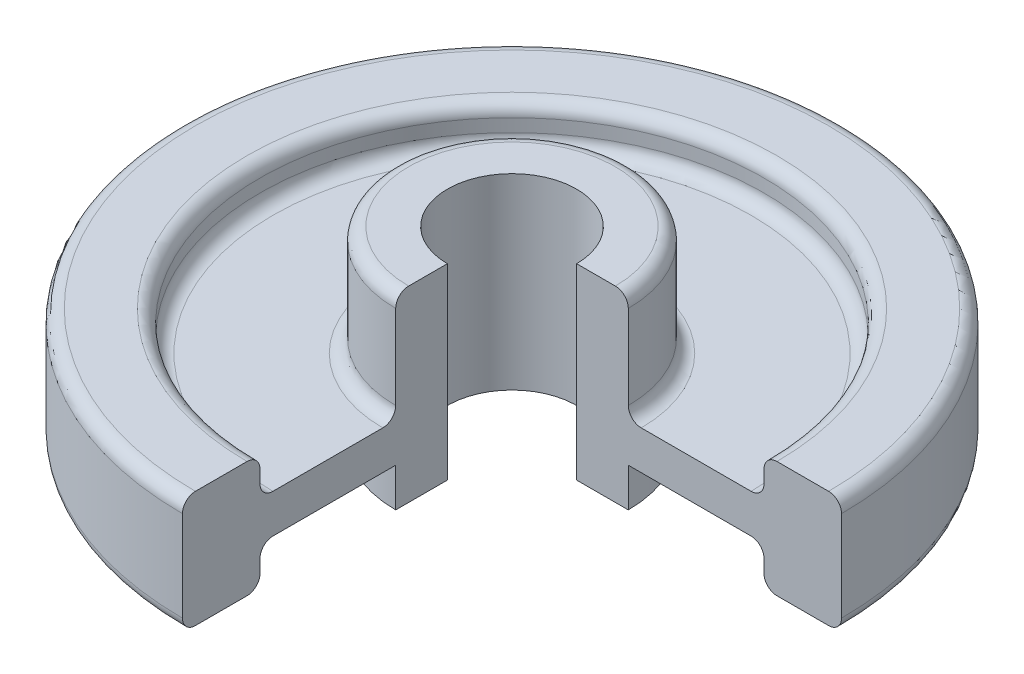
ISO-10303-21;
HEADER;
FILE_DESCRIPTION(('STEP AP214'),'2;1');
FILE_NAME('part.step','',(''),(''),'','','');
FILE_SCHEMA(('AUTOMOTIVE_DESIGN { 1 0 10303 214 1 1 1 1 }'));
ENDSEC;
DATA;
#1=APPLICATION_CONTEXT('core data for automotive mechanical design processes');
#2=APPLICATION_PROTOCOL_DEFINITION('international standard','automotive_design',2000,#1);
#3=PRODUCT_CONTEXT('',#1,'mechanical');
#4=PRODUCT('Part','Part','',(#3));
#5=PRODUCT_RELATED_PRODUCT_CATEGORY('part','',(#4));
#6=PRODUCT_DEFINITION_FORMATION('','',#4);
#7=PRODUCT_DEFINITION_CONTEXT('part definition',#1,'design');
#8=PRODUCT_DEFINITION('design','',#6,#7);
#9=PRODUCT_DEFINITION_SHAPE('','',#8);
#10=(LENGTH_UNIT() NAMED_UNIT(*) SI_UNIT(.MILLI.,.METRE.));
#11=(NAMED_UNIT(*) PLANE_ANGLE_UNIT() SI_UNIT($,.RADIAN.));
#12=(NAMED_UNIT(*) SI_UNIT($,.STERADIAN.) SOLID_ANGLE_UNIT());
#13=UNCERTAINTY_MEASURE_WITH_UNIT(LENGTH_MEASURE(1.E-05),#10,'distance_accuracy_value','');
#14=(GEOMETRIC_REPRESENTATION_CONTEXT(3) GLOBAL_UNCERTAINTY_ASSIGNED_CONTEXT((#13)) GLOBAL_UNIT_ASSIGNED_CONTEXT((#10,
#11,#12)) REPRESENTATION_CONTEXT('',''));
#15=CARTESIAN_POINT('',(0.,0.,0.));
#16=DIRECTION('',(0.,0.,1.));
#17=DIRECTION('',(1.,0.,0.));
#18=AXIS2_PLACEMENT_3D('',#15,#16,#17);
#19=CARTESIAN_POINT('',(0.,0.,0.));
#20=DIRECTION('',(0.,-1.,0.));
#21=DIRECTION('',(0.,0.,-1.));
#22=AXIS2_PLACEMENT_3D('',#19,#20,#21);
#23=PLANE('',#22);
#24=DIRECTION('',(-1.,0.,0.));
#25=VECTOR('',#24,1.);
#26=CARTESIAN_POINT('',(80.9625,0.,0.));
#27=LINE('',#26,#25);
#28=CARTESIAN_POINT('',(28.575,0.,0.));
#29=VERTEX_POINT('',#28);
#30=CARTESIAN_POINT('',(15.875,0.,0.));
#31=VERTEX_POINT('',#30);
#32=EDGE_CURVE('E171',#29,#31,#27,.T.);
#33=ORIENTED_EDGE('',*,*,#32,.T.);
#34=CARTESIAN_POINT('',(0.,0.,0.));
#35=DIRECTION('',(0.,1.,0.));
#36=DIRECTION('',(0.,0.,1.));
#37=AXIS2_PLACEMENT_3D('',#34,#35,#36);
#38=CIRCLE('',#37,15.875);
#39=CARTESIAN_POINT('',(0.,0.,15.875));
#40=VERTEX_POINT('',#39);
#41=EDGE_CURVE('E228',#31,#40,#38,.T.);
#42=ORIENTED_EDGE('',*,*,#41,.T.);
#43=DIRECTION('',(0.,0.,1.));
#44=VECTOR('',#43,1.);
#45=CARTESIAN_POINT('',(0.,0.,0.));
#46=LINE('',#45,#44);
#47=CARTESIAN_POINT('',(0.,0.,28.575));
#48=VERTEX_POINT('',#47);
#49=EDGE_CURVE('E316',#40,#48,#46,.T.);
#50=ORIENTED_EDGE('',*,*,#49,.T.);
#51=CARTESIAN_POINT('',(0.,0.,0.));
#52=DIRECTION('',(0.,-1.,0.));
#53=DIRECTION('',(0.,0.,-1.));
#54=AXIS2_PLACEMENT_3D('',#51,#52,#53);
#55=CIRCLE('',#54,28.575);
#56=EDGE_CURVE('E237',#48,#29,#55,.T.);
#57=ORIENTED_EDGE('',*,*,#56,.T.);
#58=EDGE_LOOP('',(#33,#42,#50,#57));
#59=FACE_BOUND('',#58,.T.);
#60=ADVANCED_FACE('F28',(#59),#23,.T.);
#61=CARTESIAN_POINT('',(77.7875,0.,0.));
#62=VERTEX_POINT('',#61);
#63=CARTESIAN_POINT('',(65.0875,0.,0.));
#64=VERTEX_POINT('',#63);
#65=EDGE_CURVE('E162',#62,#64,#27,.T.);
#66=ORIENTED_EDGE('',*,*,#65,.T.);
#67=CARTESIAN_POINT('',(0.,0.,0.));
#68=DIRECTION('',(0.,-1.,0.));
#69=DIRECTION('',(0.,0.,-1.));
#70=AXIS2_PLACEMENT_3D('',#67,#68,#69);
#71=CIRCLE('',#70,65.0875);
#72=CARTESIAN_POINT('',(0.,0.,65.0875));
#73=VERTEX_POINT('',#72);
#74=EDGE_CURVE('E184',#64,#73,#71,.F.);
#75=ORIENTED_EDGE('',*,*,#74,.T.);
#76=CARTESIAN_POINT('',(0.,0.,77.7875));
#77=VERTEX_POINT('',#76);
#78=EDGE_CURVE('E50',#73,#77,#46,.T.);
#79=ORIENTED_EDGE('',*,*,#78,.T.);
#80=CARTESIAN_POINT('',(0.,0.,0.));
#81=DIRECTION('',(0.,-1.,0.));
#82=DIRECTION('',(0.,0.,-1.));
#83=AXIS2_PLACEMENT_3D('',#80,#81,#82);
#84=CIRCLE('',#83,77.7875);
#85=EDGE_CURVE('E178',#77,#62,#84,.T.);
#86=ORIENTED_EDGE('',*,*,#85,.T.);
#87=EDGE_LOOP('',(#66,#75,#79,#86));
#88=FACE_BOUND('',#87,.T.);
#89=ADVANCED_FACE('F30',(#88),#23,.T.);
#90=CARTESIAN_POINT('',(0.,0.,0.));
#91=DIRECTION('',(0.,-1.,0.));
#92=DIRECTION('',(0.,0.,-1.));
#93=AXIS2_PLACEMENT_3D('',#90,#91,#92);
#94=CYLINDRICAL_SURFACE('',#93,80.9625);
#95=DIRECTION('',(0.,1.,0.));
#96=VECTOR('',#95,1.);
#97=CARTESIAN_POINT('',(80.9625,0.,0.));
#98=LINE('',#97,#96);
#99=CARTESIAN_POINT('',(80.9625,3.175,0.));
#100=VERTEX_POINT('',#99);
#101=CARTESIAN_POINT('',(80.9625,25.4,0.));
#102=VERTEX_POINT('',#101);
#103=EDGE_CURVE('E312',#100,#102,#98,.T.);
#104=ORIENTED_EDGE('',*,*,#103,.F.);
#105=CARTESIAN_POINT('',(0.,3.175,0.));
#106=DIRECTION('',(0.,-1.,0.));
#107=DIRECTION('',(0.,0.,-1.));
#108=AXIS2_PLACEMENT_3D('',#105,#106,#107);
#109=CIRCLE('',#108,80.9625);
#110=CARTESIAN_POINT('',(0.,3.175,80.9625));
#111=VERTEX_POINT('',#110);
#112=EDGE_CURVE('E180',#100,#111,#109,.F.);
#113=ORIENTED_EDGE('',*,*,#112,.T.);
#114=DIRECTION('',(0.,1.,0.));
#115=VECTOR('',#114,1.);
#116=CARTESIAN_POINT('',(0.,0.,80.9625));
#117=LINE('',#116,#115);
#118=CARTESIAN_POINT('',(0.,25.4,80.9625));
#119=VERTEX_POINT('',#118);
#120=EDGE_CURVE('E313',#111,#119,#117,.T.);
#121=ORIENTED_EDGE('',*,*,#120,.T.);
#122=CARTESIAN_POINT('',(0.,25.4,0.));
#123=DIRECTION('',(0.,1.,0.));
#124=DIRECTION('',(0.,0.,1.));
#125=AXIS2_PLACEMENT_3D('',#122,#123,#124);
#126=CIRCLE('',#125,80.9625);
#127=EDGE_CURVE('E186',#119,#102,#126,.F.);
#128=ORIENTED_EDGE('',*,*,#127,.T.);
#129=EDGE_LOOP('',(#104,#113,#121,#128));
#130=FACE_BOUND('',#129,.T.);
#131=ADVANCED_FACE('F371',(#130),#94,.T.);
#132=CARTESIAN_POINT('',(80.9625,28.575,0.));
#133=DIRECTION('',(0.,1.,0.));
#134=DIRECTION('',(0.,0.,1.));
#135=AXIS2_PLACEMENT_3D('',#132,#133,#134);
#136=PLANE('',#135);
#137=DIRECTION('',(-1.,0.,0.));
#138=VECTOR('',#137,1.);
#139=CARTESIAN_POINT('',(80.9625,28.575,0.));
#140=LINE('',#139,#138);
#141=CARTESIAN_POINT('',(77.7875,28.575,0.));
#142=VERTEX_POINT('',#141);
#143=CARTESIAN_POINT('',(65.0875,28.575,0.));
#144=VERTEX_POINT('',#143);
#145=EDGE_CURVE('E261',#142,#144,#140,.T.);
#146=ORIENTED_EDGE('',*,*,#145,.F.);
#147=CARTESIAN_POINT('',(0.,28.575,0.));
#148=DIRECTION('',(0.,1.,0.));
#149=DIRECTION('',(0.,0.,1.));
#150=AXIS2_PLACEMENT_3D('',#147,#148,#149);
#151=CIRCLE('',#150,77.7875);
#152=CARTESIAN_POINT('',(0.,28.575,77.7875));
#153=VERTEX_POINT('',#152);
#154=EDGE_CURVE('E195',#142,#153,#151,.T.);
#155=ORIENTED_EDGE('',*,*,#154,.T.);
#156=DIRECTION('',(0.,0.,1.));
#157=VECTOR('',#156,1.);
#158=CARTESIAN_POINT('',(0.,28.575,0.));
#159=LINE('',#158,#157);
#160=CARTESIAN_POINT('',(0.,28.575,65.0875));
#161=VERTEX_POINT('',#160);
#162=EDGE_CURVE('E294',#161,#153,#159,.T.);
#163=ORIENTED_EDGE('',*,*,#162,.F.);
#164=CARTESIAN_POINT('',(0.,28.575,0.));
#165=DIRECTION('',(0.,1.,0.));
#166=DIRECTION('',(0.,0.,1.));
#167=AXIS2_PLACEMENT_3D('',#164,#165,#166);
#168=CIRCLE('',#167,65.0875);
#169=EDGE_CURVE('E192',#161,#144,#168,.F.);
#170=ORIENTED_EDGE('',*,*,#169,.T.);
#171=EDGE_LOOP('',(#146,#155,#163,#170));
#172=FACE_BOUND('',#171,.T.);
#173=ADVANCED_FACE('F363',(#172),#136,.T.);
#174=CARTESIAN_POINT('',(0.,0.,0.));
#175=DIRECTION('',(0.,-1.,0.));
#176=DIRECTION('',(0.,0.,-1.));
#177=AXIS2_PLACEMENT_3D('',#174,#175,#176);
#178=CYLINDRICAL_SURFACE('',#177,28.575);
#179=DIRECTION('',(0.,-1.,0.));
#180=VECTOR('',#179,1.);
#181=CARTESIAN_POINT('',(28.575,0.,0.));
#182=LINE('',#181,#180);
#183=CARTESIAN_POINT('',(28.575,22.225,0.));
#184=VERTEX_POINT('',#183);
#185=CARTESIAN_POINT('',(28.575,42.8752,0.));
#186=VERTEX_POINT('',#185);
#187=EDGE_CURVE('E245',#184,#186,#182,.F.);
#188=ORIENTED_EDGE('',*,*,#187,.F.);
#189=CARTESIAN_POINT('',(0.,22.225,0.));
#190=DIRECTION('',(0.,-1.,0.));
#191=DIRECTION('',(0.,0.,-1.));
#192=AXIS2_PLACEMENT_3D('',#189,#190,#191);
#193=CIRCLE('',#192,28.575);
#194=CARTESIAN_POINT('',(0.,22.225,28.575));
#195=VERTEX_POINT('',#194);
#196=EDGE_CURVE('E216',#184,#195,#193,.F.);
#197=ORIENTED_EDGE('',*,*,#196,.T.);
#198=DIRECTION('',(0.,-1.,0.));
#199=VECTOR('',#198,1.);
#200=CARTESIAN_POINT('',(0.,0.,28.575));
#201=LINE('',#200,#199);
#202=CARTESIAN_POINT('',(0.,42.8752,28.575));
#203=VERTEX_POINT('',#202);
#204=EDGE_CURVE('E278',#203,#195,#201,.T.);
#205=ORIENTED_EDGE('',*,*,#204,.F.);
#206=CARTESIAN_POINT('',(0.,42.8752,0.));
#207=DIRECTION('',(0.,1.,0.));
#208=DIRECTION('',(0.,0.,1.));
#209=AXIS2_PLACEMENT_3D('',#206,#207,#208);
#210=CIRCLE('',#209,28.575);
#211=EDGE_CURVE('E213',#203,#186,#210,.F.);
#212=ORIENTED_EDGE('',*,*,#211,.T.);
#213=EDGE_LOOP('',(#188,#197,#205,#212));
#214=FACE_BOUND('',#213,.T.);
#215=ADVANCED_FACE('F341',(#214),#178,.T.);
#216=CARTESIAN_POINT('',(28.575,46.0502,0.));
#217=DIRECTION('',(0.,1.,0.));
#218=DIRECTION('',(0.,0.,1.));
#219=AXIS2_PLACEMENT_3D('',#216,#217,#218);
#220=PLANE('',#219);
#221=DIRECTION('',(-1.,0.,0.));
#222=VECTOR('',#221,1.);
#223=CARTESIAN_POINT('',(80.9625,46.0502,0.));
#224=LINE('',#223,#222);
#225=CARTESIAN_POINT('',(25.4,46.0502,0.));
#226=VERTEX_POINT('',#225);
#227=CARTESIAN_POINT('',(15.875,46.0502,0.));
#228=VERTEX_POINT('',#227);
#229=EDGE_CURVE('E322',#226,#228,#224,.T.);
#230=ORIENTED_EDGE('',*,*,#229,.F.);
#231=CARTESIAN_POINT('',(0.,46.0502,0.));
#232=DIRECTION('',(0.,1.,0.));
#233=DIRECTION('',(0.,0.,1.));
#234=AXIS2_PLACEMENT_3D('',#231,#232,#233);
#235=CIRCLE('',#234,25.4);
#236=CARTESIAN_POINT('',(0.,46.0502,25.4));
#237=VERTEX_POINT('',#236);
#238=EDGE_CURVE('E210',#226,#237,#235,.T.);
#239=ORIENTED_EDGE('',*,*,#238,.T.);
#240=DIRECTION('',(0.,0.,1.));
#241=VECTOR('',#240,1.);
#242=CARTESIAN_POINT('',(0.,46.0502,0.));
#243=LINE('',#242,#241);
#244=CARTESIAN_POINT('',(0.,46.0502,15.875));
#245=VERTEX_POINT('',#244);
#246=EDGE_CURVE('E320',#245,#237,#243,.T.);
#247=ORIENTED_EDGE('',*,*,#246,.F.);
#248=CARTESIAN_POINT('',(0.,46.0502,0.));
#249=DIRECTION('',(0.,1.,0.));
#250=DIRECTION('',(0.,0.,1.));
#251=AXIS2_PLACEMENT_3D('',#248,#249,#250);
#252=CIRCLE('',#251,15.875);
#253=EDGE_CURVE('E231',#228,#245,#252,.T.);
#254=ORIENTED_EDGE('',*,*,#253,.F.);
#255=EDGE_LOOP('',(#230,#239,#247,#254));
#256=FACE_BOUND('',#255,.T.);
#257=ADVANCED_FACE('F332',(#256),#220,.T.);
#258=CARTESIAN_POINT('',(0.,0.,0.));
#259=DIRECTION('',(0.,1.,0.));
#260=DIRECTION('',(0.,0.,1.));
#261=AXIS2_PLACEMENT_3D('',#258,#259,#260);
#262=CYLINDRICAL_SURFACE('',#261,15.875);
#263=ORIENTED_EDGE('',*,*,#41,.F.);
#264=DIRECTION('',(0.,1.,0.));
#265=VECTOR('',#264,1.);
#266=CARTESIAN_POINT('',(15.875,0.,0.));
#267=LINE('',#266,#265);
#268=EDGE_CURVE('E240',#31,#228,#267,.T.);
#269=ORIENTED_EDGE('',*,*,#268,.T.);
#270=ORIENTED_EDGE('',*,*,#253,.T.);
#271=DIRECTION('',(0.,1.,0.));
#272=VECTOR('',#271,1.);
#273=CARTESIAN_POINT('',(0.,0.,15.875));
#274=LINE('',#273,#272);
#275=EDGE_CURVE('E273',#245,#40,#274,.F.);
#276=ORIENTED_EDGE('',*,*,#275,.T.);
#277=EDGE_LOOP('',(#263,#269,#270,#276));
#278=FACE_BOUND('',#277,.T.);
#279=ADVANCED_FACE('F330',(#278),#262,.F.);
#280=CARTESIAN_POINT('',(0.,0.,0.));
#281=DIRECTION('',(0.,-1.,0.));
#282=DIRECTION('',(0.,0.,-1.));
#283=AXIS2_PLACEMENT_3D('',#280,#281,#282);
#284=CYLINDRICAL_SURFACE('',#283,61.9125);
#285=CARTESIAN_POINT('',(0.,22.225,0.));
#286=DIRECTION('',(0.,-1.,0.));
#287=DIRECTION('',(0.,0.,-1.));
#288=AXIS2_PLACEMENT_3D('',#285,#286,#287);
#289=CIRCLE('',#288,61.9125);
#290=CARTESIAN_POINT('',(0.,22.225,61.9125));
#291=VERTEX_POINT('',#290);
#292=CARTESIAN_POINT('',(61.9125,22.225,0.));
#293=VERTEX_POINT('',#292);
#294=EDGE_CURVE('E198',#291,#293,#289,.T.);
#295=ORIENTED_EDGE('',*,*,#294,.T.);
#296=DIRECTION('',(0.,-1.,0.));
#297=VECTOR('',#296,1.);
#298=CARTESIAN_POINT('',(61.9125,0.,0.));
#299=LINE('',#298,#297);
#300=CARTESIAN_POINT('',(61.9125,25.4,0.));
#301=VERTEX_POINT('',#300);
#302=EDGE_CURVE('E256',#293,#301,#299,.F.);
#303=ORIENTED_EDGE('',*,*,#302,.T.);
#304=CARTESIAN_POINT('',(0.,25.4,0.));
#305=DIRECTION('',(0.,1.,0.));
#306=DIRECTION('',(0.,0.,1.));
#307=AXIS2_PLACEMENT_3D('',#304,#305,#306);
#308=CIRCLE('',#307,61.9125);
#309=CARTESIAN_POINT('',(0.,25.4,61.9125));
#310=VERTEX_POINT('',#309);
#311=EDGE_CURVE('E201',#301,#310,#308,.T.);
#312=ORIENTED_EDGE('',*,*,#311,.T.);
#313=DIRECTION('',(0.,-1.,0.));
#314=VECTOR('',#313,1.);
#315=CARTESIAN_POINT('',(0.,0.,61.9125));
#316=LINE('',#315,#314);
#317=EDGE_CURVE('E289',#310,#291,#316,.T.);
#318=ORIENTED_EDGE('',*,*,#317,.T.);
#319=EDGE_LOOP('',(#295,#303,#312,#318));
#320=FACE_BOUND('',#319,.T.);
#321=ADVANCED_FACE('F353',(#320),#284,.F.);
#322=CARTESIAN_POINT('',(28.575,19.05,0.));
#323=DIRECTION('',(0.,-1.,0.));
#324=DIRECTION('',(0.,0.,-1.));
#325=AXIS2_PLACEMENT_3D('',#322,#323,#324);
#326=PLANE('',#325);
#327=CARTESIAN_POINT('',(0.,19.05,0.));
#328=DIRECTION('',(0.,-1.,0.));
#329=DIRECTION('',(0.,0.,-1.));
#330=AXIS2_PLACEMENT_3D('',#327,#328,#329);
#331=CIRCLE('',#330,31.75);
#332=CARTESIAN_POINT('',(0.,19.05,31.75));
#333=VERTEX_POINT('',#332);
#334=CARTESIAN_POINT('',(31.75,19.05,0.));
#335=VERTEX_POINT('',#334);
#336=EDGE_CURVE('E204',#333,#335,#331,.T.);
#337=ORIENTED_EDGE('',*,*,#336,.T.);
#338=DIRECTION('',(1.,0.,0.));
#339=VECTOR('',#338,1.);
#340=CARTESIAN_POINT('',(28.575,19.05,0.));
#341=LINE('',#340,#339);
#342=CARTESIAN_POINT('',(58.7375,19.05,0.));
#343=VERTEX_POINT('',#342);
#344=EDGE_CURVE('E250',#335,#343,#341,.T.);
#345=ORIENTED_EDGE('',*,*,#344,.T.);
#346=CARTESIAN_POINT('',(0.,19.05,0.));
#347=DIRECTION('',(0.,-1.,0.));
#348=DIRECTION('',(0.,0.,-1.));
#349=AXIS2_PLACEMENT_3D('',#346,#347,#348);
#350=CIRCLE('',#349,58.7375);
#351=CARTESIAN_POINT('',(0.,19.05,58.7375));
#352=VERTEX_POINT('',#351);
#353=EDGE_CURVE('E207',#343,#352,#350,.F.);
#354=ORIENTED_EDGE('',*,*,#353,.T.);
#355=DIRECTION('',(0.,0.,-1.));
#356=VECTOR('',#355,1.);
#357=CARTESIAN_POINT('',(0.,19.05,0.));
#358=LINE('',#357,#356);
#359=EDGE_CURVE('E283',#352,#333,#358,.T.);
#360=ORIENTED_EDGE('',*,*,#359,.T.);
#361=EDGE_LOOP('',(#337,#345,#354,#360));
#362=FACE_BOUND('',#361,.T.);
#363=ADVANCED_FACE('F347',(#362),#326,.F.);
#364=CARTESIAN_POINT('',(61.9125,9.525,0.));
#365=DIRECTION('',(0.,1.,0.));
#366=DIRECTION('',(0.,0.,1.));
#367=AXIS2_PLACEMENT_3D('',#364,#365,#366);
#368=PLANE('',#367);
#369=CARTESIAN_POINT('',(0.,9.525,0.));
#370=DIRECTION('',(0.,1.,0.));
#371=DIRECTION('',(0.,0.,1.));
#372=AXIS2_PLACEMENT_3D('',#369,#370,#371);
#373=CIRCLE('',#372,58.7375);
#374=CARTESIAN_POINT('',(0.,9.525,58.7375));
#375=VERTEX_POINT('',#374);
#376=CARTESIAN_POINT('',(58.7375,9.525,0.));
#377=VERTEX_POINT('',#376);
#378=EDGE_CURVE('E225',#375,#377,#373,.F.);
#379=ORIENTED_EDGE('',*,*,#378,.T.);
#380=DIRECTION('',(-1.,0.,0.));
#381=VECTOR('',#380,1.);
#382=CARTESIAN_POINT('',(61.9125,9.525,0.));
#383=LINE('',#382,#381);
#384=CARTESIAN_POINT('',(28.575,9.525,0.));
#385=VERTEX_POINT('',#384);
#386=EDGE_CURVE('E266',#377,#385,#383,.T.);
#387=ORIENTED_EDGE('',*,*,#386,.T.);
#388=CARTESIAN_POINT('',(0.,9.525,0.));
#389=DIRECTION('',(0.,-1.,0.));
#390=DIRECTION('',(0.,0.,-1.));
#391=AXIS2_PLACEMENT_3D('',#388,#389,#390);
#392=CIRCLE('',#391,28.575);
#393=CARTESIAN_POINT('',(0.,9.525,28.575));
#394=VERTEX_POINT('',#393);
#395=EDGE_CURVE('E234',#394,#385,#392,.T.);
#396=ORIENTED_EDGE('',*,*,#395,.F.);
#397=DIRECTION('',(0.,0.,1.));
#398=VECTOR('',#397,1.);
#399=CARTESIAN_POINT('',(0.,9.525,0.));
#400=LINE('',#399,#398);
#401=EDGE_CURVE('E303',#394,#375,#400,.T.);
#402=ORIENTED_EDGE('',*,*,#401,.T.);
#403=EDGE_LOOP('',(#379,#387,#396,#402));
#404=FACE_BOUND('',#403,.T.);
#405=ADVANCED_FACE('F388',(#404),#368,.F.);
#406=CARTESIAN_POINT('',(0.,0.,0.));
#407=DIRECTION('',(0.,-1.,0.));
#408=DIRECTION('',(0.,0.,-1.));
#409=AXIS2_PLACEMENT_3D('',#406,#407,#408);
#410=CYLINDRICAL_SURFACE('',#409,28.575);
#411=ORIENTED_EDGE('',*,*,#395,.T.);
#412=DIRECTION('',(0.,-1.,0.));
#413=VECTOR('',#412,1.);
#414=CARTESIAN_POINT('',(28.575,0.,0.));
#415=LINE('',#414,#413);
#416=EDGE_CURVE('E182',#385,#29,#415,.T.);
#417=ORIENTED_EDGE('',*,*,#416,.T.);
#418=ORIENTED_EDGE('',*,*,#56,.F.);
#419=DIRECTION('',(0.,-1.,0.));
#420=VECTOR('',#419,1.);
#421=CARTESIAN_POINT('',(0.,0.,28.575));
#422=LINE('',#421,#420);
#423=EDGE_CURVE('E300',#48,#394,#422,.F.);
#424=ORIENTED_EDGE('',*,*,#423,.T.);
#425=EDGE_LOOP('',(#411,#417,#418,#424));
#426=FACE_BOUND('',#425,.T.);
#427=ADVANCED_FACE('F385',(#426),#410,.T.);
#428=CARTESIAN_POINT('',(0.,0.,0.));
#429=DIRECTION('',(0.,-1.,0.));
#430=DIRECTION('',(0.,0.,-1.));
#431=AXIS2_PLACEMENT_3D('',#428,#429,#430);
#432=CYLINDRICAL_SURFACE('',#431,61.9125);
#433=CARTESIAN_POINT('',(0.,3.175,0.));
#434=DIRECTION('',(0.,-1.,0.));
#435=DIRECTION('',(0.,0.,-1.));
#436=AXIS2_PLACEMENT_3D('',#433,#434,#435);
#437=CIRCLE('',#436,61.9125);
#438=CARTESIAN_POINT('',(0.,3.175,61.9125));
#439=VERTEX_POINT('',#438);
#440=CARTESIAN_POINT('',(61.9125,3.175,0.));
#441=VERTEX_POINT('',#440);
#442=EDGE_CURVE('E222',#439,#441,#437,.T.);
#443=ORIENTED_EDGE('',*,*,#442,.T.);
#444=DIRECTION('',(0.,-1.,0.));
#445=VECTOR('',#444,1.);
#446=CARTESIAN_POINT('',(61.9125,0.,0.));
#447=LINE('',#446,#445);
#448=CARTESIAN_POINT('',(61.9125,6.35,0.));
#449=VERTEX_POINT('',#448);
#450=EDGE_CURVE('E42',#441,#449,#447,.F.);
#451=ORIENTED_EDGE('',*,*,#450,.T.);
#452=CARTESIAN_POINT('',(0.,6.35,0.));
#453=DIRECTION('',(0.,1.,0.));
#454=DIRECTION('',(0.,0.,1.));
#455=AXIS2_PLACEMENT_3D('',#452,#453,#454);
#456=CIRCLE('',#455,61.9125);
#457=CARTESIAN_POINT('',(0.,6.35,61.9125));
#458=VERTEX_POINT('',#457);
#459=EDGE_CURVE('E219',#449,#458,#456,.T.);
#460=ORIENTED_EDGE('',*,*,#459,.T.);
#461=DIRECTION('',(0.,-1.,0.));
#462=VECTOR('',#461,1.);
#463=CARTESIAN_POINT('',(0.,0.,61.9125));
#464=LINE('',#463,#462);
#465=EDGE_CURVE('E309',#458,#439,#464,.T.);
#466=ORIENTED_EDGE('',*,*,#465,.T.);
#467=EDGE_LOOP('',(#443,#451,#460,#466));
#468=FACE_BOUND('',#467,.T.);
#469=ADVANCED_FACE('F394',(#468),#432,.F.);
#470=CARTESIAN_POINT('',(0.,6.35,0.));
#471=DIRECTION('',(0.,1.,0.));
#472=DIRECTION('',(0.,0.,1.));
#473=AXIS2_PLACEMENT_3D('',#470,#471,#472);
#474=TOROIDAL_SURFACE('',#473,58.7375,3.175);
#475=ORIENTED_EDGE('',*,*,#459,.F.);
#476=CARTESIAN_POINT('',(58.7375,6.35,0.));
#477=DIRECTION('',(0.,0.,-1.));
#478=DIRECTION('',(-1.,0.,0.));
#479=AXIS2_PLACEMENT_3D('',#476,#477,#478);
#480=CIRCLE('',#479,3.175);
#481=EDGE_CURVE('E269',#449,#377,#480,.F.);
#482=ORIENTED_EDGE('',*,*,#481,.T.);
#483=ORIENTED_EDGE('',*,*,#378,.F.);
#484=CARTESIAN_POINT('',(0.,6.35,58.7375));
#485=DIRECTION('',(-1.,0.,0.));
#486=DIRECTION('',(0.,0.,1.));
#487=AXIS2_PLACEMENT_3D('',#484,#485,#486);
#488=CIRCLE('',#487,3.175);
#489=EDGE_CURVE('E306',#375,#458,#488,.F.);
#490=ORIENTED_EDGE('',*,*,#489,.T.);
#491=EDGE_LOOP('',(#475,#482,#483,#490));
#492=FACE_BOUND('',#491,.T.);
#493=ADVANCED_FACE('F392',(#492),#474,.F.);
#494=CARTESIAN_POINT('',(0.,42.8752,0.));
#495=DIRECTION('',(0.,1.,0.));
#496=DIRECTION('',(0.,0.,1.));
#497=AXIS2_PLACEMENT_3D('',#494,#495,#496);
#498=TOROIDAL_SURFACE('',#497,25.4,3.175);
#499=CARTESIAN_POINT('',(25.4,42.8752,0.));
#500=DIRECTION('',(0.,0.,-1.));
#501=DIRECTION('',(-1.,0.,0.));
#502=AXIS2_PLACEMENT_3D('',#499,#500,#501);
#503=CIRCLE('',#502,3.175);
#504=EDGE_CURVE('E243',#186,#226,#503,.F.);
#505=ORIENTED_EDGE('',*,*,#504,.F.);
#506=ORIENTED_EDGE('',*,*,#211,.F.);
#507=CARTESIAN_POINT('',(0.,42.8752,25.4));
#508=DIRECTION('',(-1.,0.,0.));
#509=DIRECTION('',(0.,0.,1.));
#510=AXIS2_PLACEMENT_3D('',#507,#508,#509);
#511=CIRCLE('',#510,3.175);
#512=EDGE_CURVE('E276',#237,#203,#511,.F.);
#513=ORIENTED_EDGE('',*,*,#512,.F.);
#514=ORIENTED_EDGE('',*,*,#238,.F.);
#515=EDGE_LOOP('',(#505,#506,#513,#514));
#516=FACE_BOUND('',#515,.T.);
#517=ADVANCED_FACE('F338',(#516),#498,.T.);
#518=CARTESIAN_POINT('',(0.,22.225,0.));
#519=DIRECTION('',(0.,-1.,0.));
#520=DIRECTION('',(0.,0.,-1.));
#521=AXIS2_PLACEMENT_3D('',#518,#519,#520);
#522=TOROIDAL_SURFACE('',#521,31.75,3.175);
#523=ORIENTED_EDGE('',*,*,#196,.F.);
#524=CARTESIAN_POINT('',(31.75,22.225,0.));
#525=DIRECTION('',(0.,0.,-1.));
#526=DIRECTION('',(-1.,0.,0.));
#527=AXIS2_PLACEMENT_3D('',#524,#525,#526);
#528=CIRCLE('',#527,3.175);
#529=EDGE_CURVE('E247',#184,#335,#528,.F.);
#530=ORIENTED_EDGE('',*,*,#529,.T.);
#531=ORIENTED_EDGE('',*,*,#336,.F.);
#532=CARTESIAN_POINT('',(0.,22.225,31.75));
#533=DIRECTION('',(-1.,0.,0.));
#534=DIRECTION('',(0.,0.,1.));
#535=AXIS2_PLACEMENT_3D('',#532,#533,#534);
#536=CIRCLE('',#535,3.175);
#537=EDGE_CURVE('E280',#333,#195,#536,.F.);
#538=ORIENTED_EDGE('',*,*,#537,.T.);
#539=EDGE_LOOP('',(#523,#530,#531,#538));
#540=FACE_BOUND('',#539,.T.);
#541=ADVANCED_FACE('F345',(#540),#522,.F.);
#542=CARTESIAN_POINT('',(0.,22.225,0.));
#543=DIRECTION('',(0.,-1.,0.));
#544=DIRECTION('',(0.,0.,-1.));
#545=AXIS2_PLACEMENT_3D('',#542,#543,#544);
#546=TOROIDAL_SURFACE('',#545,58.7375,3.175);
#547=ORIENTED_EDGE('',*,*,#353,.F.);
#548=CARTESIAN_POINT('',(58.7375,22.225,0.));
#549=DIRECTION('',(0.,0.,-1.));
#550=DIRECTION('',(-1.,0.,0.));
#551=AXIS2_PLACEMENT_3D('',#548,#549,#550);
#552=CIRCLE('',#551,3.175);
#553=EDGE_CURVE('E253',#343,#293,#552,.F.);
#554=ORIENTED_EDGE('',*,*,#553,.T.);
#555=ORIENTED_EDGE('',*,*,#294,.F.);
#556=CARTESIAN_POINT('',(0.,22.225,58.7375));
#557=DIRECTION('',(-1.,0.,0.));
#558=DIRECTION('',(0.,0.,1.));
#559=AXIS2_PLACEMENT_3D('',#556,#557,#558);
#560=CIRCLE('',#559,3.175);
#561=EDGE_CURVE('E286',#291,#352,#560,.F.);
#562=ORIENTED_EDGE('',*,*,#561,.T.);
#563=EDGE_LOOP('',(#547,#554,#555,#562));
#564=FACE_BOUND('',#563,.T.);
#565=ADVANCED_FACE('F351',(#564),#546,.F.);
#566=CARTESIAN_POINT('',(0.,25.4,0.));
#567=DIRECTION('',(0.,1.,0.));
#568=DIRECTION('',(0.,0.,1.));
#569=AXIS2_PLACEMENT_3D('',#566,#567,#568);
#570=TOROIDAL_SURFACE('',#569,65.0875,3.175);
#571=CARTESIAN_POINT('',(65.0875,25.4,0.));
#572=DIRECTION('',(0.,0.,-1.));
#573=DIRECTION('',(-1.,0.,0.));
#574=AXIS2_PLACEMENT_3D('',#571,#572,#573);
#575=CIRCLE('',#574,3.175);
#576=EDGE_CURVE('E259',#144,#301,#575,.F.);
#577=ORIENTED_EDGE('',*,*,#576,.F.);
#578=ORIENTED_EDGE('',*,*,#169,.F.);
#579=CARTESIAN_POINT('',(0.,25.4,65.0875));
#580=DIRECTION('',(-1.,0.,0.));
#581=DIRECTION('',(0.,0.,1.));
#582=AXIS2_PLACEMENT_3D('',#579,#580,#581);
#583=CIRCLE('',#582,3.175);
#584=EDGE_CURVE('E292',#310,#161,#583,.F.);
#585=ORIENTED_EDGE('',*,*,#584,.F.);
#586=ORIENTED_EDGE('',*,*,#311,.F.);
#587=EDGE_LOOP('',(#577,#578,#585,#586));
#588=FACE_BOUND('',#587,.T.);
#589=ADVANCED_FACE('F360',(#588),#570,.T.);
#590=CARTESIAN_POINT('',(0.,25.4,0.));
#591=DIRECTION('',(0.,1.,0.));
#592=DIRECTION('',(0.,0.,1.));
#593=AXIS2_PLACEMENT_3D('',#590,#591,#592);
#594=TOROIDAL_SURFACE('',#593,77.7875,3.175);
#595=CARTESIAN_POINT('',(77.7875,25.4,0.));
#596=DIRECTION('',(0.,0.,-1.));
#597=DIRECTION('',(-1.,0.,0.));
#598=AXIS2_PLACEMENT_3D('',#595,#596,#597);
#599=CIRCLE('',#598,3.175);
#600=EDGE_CURVE('E181',#102,#142,#599,.F.);
#601=ORIENTED_EDGE('',*,*,#600,.F.);
#602=ORIENTED_EDGE('',*,*,#127,.F.);
#603=CARTESIAN_POINT('',(0.,25.4,77.7875));
#604=DIRECTION('',(-1.,0.,0.));
#605=DIRECTION('',(0.,0.,1.));
#606=AXIS2_PLACEMENT_3D('',#603,#604,#605);
#607=CIRCLE('',#606,3.175);
#608=EDGE_CURVE('E296',#153,#119,#607,.F.);
#609=ORIENTED_EDGE('',*,*,#608,.F.);
#610=ORIENTED_EDGE('',*,*,#154,.F.);
#611=EDGE_LOOP('',(#601,#602,#609,#610));
#612=FACE_BOUND('',#611,.T.);
#613=ADVANCED_FACE('F369',(#612),#594,.T.);
#614=CARTESIAN_POINT('',(0.,3.175,0.));
#615=DIRECTION('',(0.,-1.,0.));
#616=DIRECTION('',(0.,0.,-1.));
#617=AXIS2_PLACEMENT_3D('',#614,#615,#616);
#618=TOROIDAL_SURFACE('',#617,77.7875,3.175);
#619=CARTESIAN_POINT('',(77.7875,3.175,0.));
#620=DIRECTION('',(0.,0.,-1.));
#621=DIRECTION('',(-1.,0.,0.));
#622=AXIS2_PLACEMENT_3D('',#619,#620,#621);
#623=CIRCLE('',#622,3.175);
#624=EDGE_CURVE('E165',#62,#100,#623,.F.);
#625=ORIENTED_EDGE('',*,*,#624,.F.);
#626=ORIENTED_EDGE('',*,*,#85,.F.);
#627=CARTESIAN_POINT('',(0.,3.175,77.7875));
#628=DIRECTION('',(-1.,0.,0.));
#629=DIRECTION('',(0.,0.,1.));
#630=AXIS2_PLACEMENT_3D('',#627,#628,#629);
#631=CIRCLE('',#630,3.175);
#632=EDGE_CURVE('E298',#111,#77,#631,.F.);
#633=ORIENTED_EDGE('',*,*,#632,.F.);
#634=ORIENTED_EDGE('',*,*,#112,.F.);
#635=EDGE_LOOP('',(#625,#626,#633,#634));
#636=FACE_BOUND('',#635,.T.);
#637=ADVANCED_FACE('F176',(#636),#618,.T.);
#638=CARTESIAN_POINT('',(0.,3.175,0.));
#639=DIRECTION('',(0.,-1.,0.));
#640=DIRECTION('',(0.,0.,-1.));
#641=AXIS2_PLACEMENT_3D('',#638,#639,#640);
#642=TOROIDAL_SURFACE('',#641,65.0875,3.175);
#643=CARTESIAN_POINT('',(65.0875,3.175,0.));
#644=DIRECTION('',(0.,0.,-1.));
#645=DIRECTION('',(-1.,0.,0.));
#646=AXIS2_PLACEMENT_3D('',#643,#644,#645);
#647=CIRCLE('',#646,3.175);
#648=EDGE_CURVE('E11',#441,#64,#647,.F.);
#649=ORIENTED_EDGE('',*,*,#648,.F.);
#650=ORIENTED_EDGE('',*,*,#442,.F.);
#651=CARTESIAN_POINT('',(0.,3.175,65.0875));
#652=DIRECTION('',(-1.,0.,0.));
#653=DIRECTION('',(0.,0.,1.));
#654=AXIS2_PLACEMENT_3D('',#651,#652,#653);
#655=CIRCLE('',#654,3.175);
#656=EDGE_CURVE('E36',#73,#439,#655,.F.);
#657=ORIENTED_EDGE('',*,*,#656,.F.);
#658=ORIENTED_EDGE('',*,*,#74,.F.);
#659=EDGE_LOOP('',(#649,#650,#657,#658));
#660=FACE_BOUND('',#659,.T.);
#661=ADVANCED_FACE('F397',(#660),#642,.T.);
#662=CARTESIAN_POINT('',(0.,0.,0.));
#663=DIRECTION('',(-1.,0.,0.));
#664=DIRECTION('',(0.,0.,1.));
#665=AXIS2_PLACEMENT_3D('',#662,#663,#664);
#666=PLANE('',#665);
#667=ORIENTED_EDGE('',*,*,#246,.T.);
#668=ORIENTED_EDGE('',*,*,#512,.T.);
#669=ORIENTED_EDGE('',*,*,#204,.T.);
#670=ORIENTED_EDGE('',*,*,#537,.F.);
#671=ORIENTED_EDGE('',*,*,#359,.F.);
#672=ORIENTED_EDGE('',*,*,#561,.F.);
#673=ORIENTED_EDGE('',*,*,#317,.F.);
#674=ORIENTED_EDGE('',*,*,#584,.T.);
#675=ORIENTED_EDGE('',*,*,#162,.T.);
#676=ORIENTED_EDGE('',*,*,#608,.T.);
#677=ORIENTED_EDGE('',*,*,#120,.F.);
#678=ORIENTED_EDGE('',*,*,#632,.T.);
#679=ORIENTED_EDGE('',*,*,#78,.F.);
#680=ORIENTED_EDGE('',*,*,#656,.T.);
#681=ORIENTED_EDGE('',*,*,#465,.F.);
#682=ORIENTED_EDGE('',*,*,#489,.F.);
#683=ORIENTED_EDGE('',*,*,#401,.F.);
#684=ORIENTED_EDGE('',*,*,#423,.F.);
#685=ORIENTED_EDGE('',*,*,#49,.F.);
#686=ORIENTED_EDGE('',*,*,#275,.F.);
#687=EDGE_LOOP('',(#667,#668,#669,#670,#671,#672,#673,#674,#675,#676,#677,#678,#679,#680,#681,
#682,#683,#684,#685,#686));
#688=FACE_BOUND('',#687,.T.);
#689=ADVANCED_FACE('F334',(#688),#666,.F.);
#690=CARTESIAN_POINT('',(80.9625,0.,0.));
#691=DIRECTION('',(0.,0.,-1.));
#692=DIRECTION('',(-1.,0.,0.));
#693=AXIS2_PLACEMENT_3D('',#690,#691,#692);
#694=PLANE('',#693);
#695=ORIENTED_EDGE('',*,*,#32,.F.);
#696=ORIENTED_EDGE('',*,*,#416,.F.);
#697=ORIENTED_EDGE('',*,*,#386,.F.);
#698=ORIENTED_EDGE('',*,*,#481,.F.);
#699=ORIENTED_EDGE('',*,*,#450,.F.);
#700=ORIENTED_EDGE('',*,*,#648,.T.);
#701=ORIENTED_EDGE('',*,*,#65,.F.);
#702=ORIENTED_EDGE('',*,*,#624,.T.);
#703=ORIENTED_EDGE('',*,*,#103,.T.);
#704=ORIENTED_EDGE('',*,*,#600,.T.);
#705=ORIENTED_EDGE('',*,*,#145,.T.);
#706=ORIENTED_EDGE('',*,*,#576,.T.);
#707=ORIENTED_EDGE('',*,*,#302,.F.);
#708=ORIENTED_EDGE('',*,*,#553,.F.);
#709=ORIENTED_EDGE('',*,*,#344,.F.);
#710=ORIENTED_EDGE('',*,*,#529,.F.);
#711=ORIENTED_EDGE('',*,*,#187,.T.);
#712=ORIENTED_EDGE('',*,*,#504,.T.);
#713=ORIENTED_EDGE('',*,*,#229,.T.);
#714=ORIENTED_EDGE('',*,*,#268,.F.);
#715=EDGE_LOOP('',(#695,#696,#697,#698,#699,#700,#701,#702,#703,#704,#705,#706,#707,#708,#709,
#710,#711,#712,#713,#714));
#716=FACE_BOUND('',#715,.T.);
#717=ADVANCED_FACE('F164',(#716),#694,.F.);
#718=CLOSED_SHELL('',(#60,#89,#131,#173,#215,#257,#279,#321,#363,#405,#427,#469,#493,#517,#541,
#565,#589,#613,#637,#661,#689,#717));
#719=MANIFOLD_SOLID_BREP('B2',#718);
#720=ADVANCED_BREP_SHAPE_REPRESENTATION('',(#18,#719),#14);
#721=SHAPE_DEFINITION_REPRESENTATION(#9,#720);
ENDSEC;
END-ISO-10303-21;
